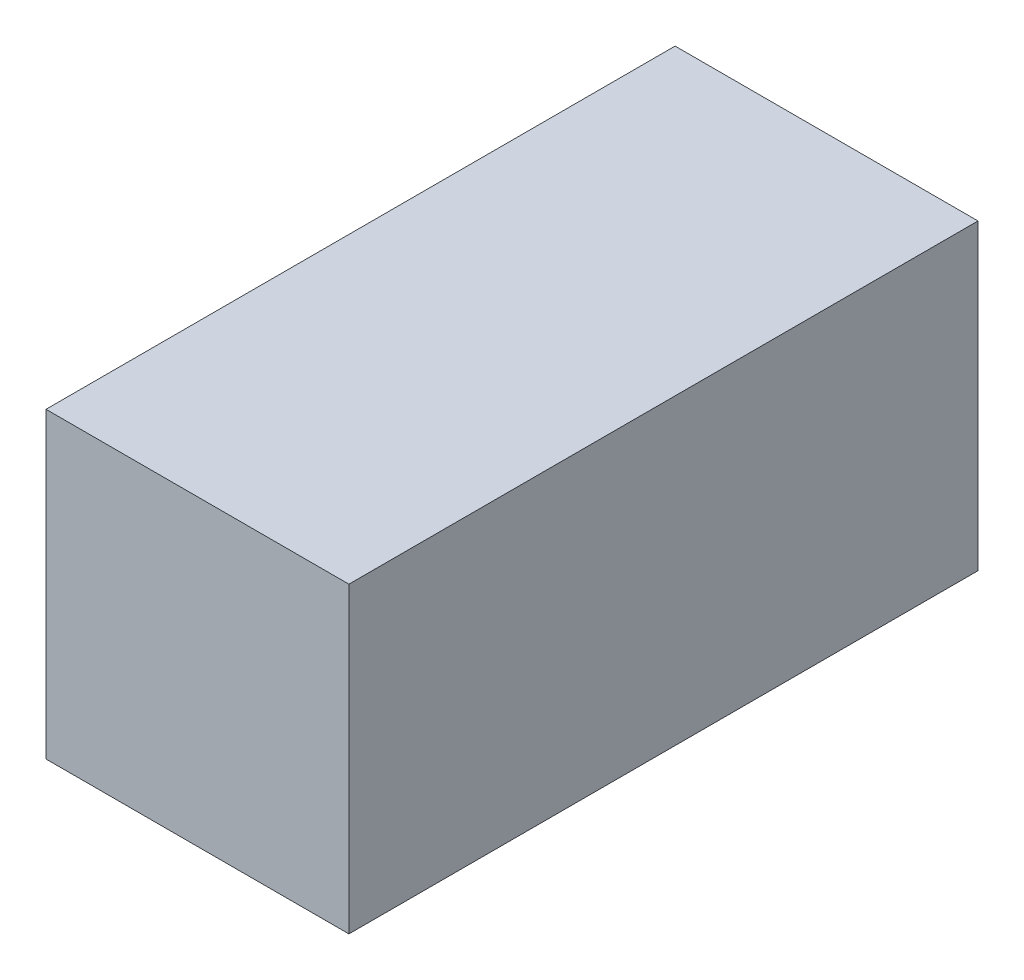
ISO-10303-21;
HEADER;
FILE_DESCRIPTION(('STEP AP214'),'2;1');
FILE_NAME('part.step','',(''),(''),'','','');
FILE_SCHEMA(('AUTOMOTIVE_DESIGN { 1 0 10303 214 1 1 1 1 }'));
ENDSEC;
DATA;
#1=APPLICATION_CONTEXT('core data for automotive mechanical design processes');
#2=APPLICATION_PROTOCOL_DEFINITION('international standard','automotive_design',2000,#1);
#3=PRODUCT_CONTEXT('',#1,'mechanical');
#4=PRODUCT('Part','Part','',(#3));
#5=PRODUCT_RELATED_PRODUCT_CATEGORY('part','',(#4));
#6=PRODUCT_DEFINITION_FORMATION('','',#4);
#7=PRODUCT_DEFINITION_CONTEXT('part definition',#1,'design');
#8=PRODUCT_DEFINITION('design','',#6,#7);
#9=PRODUCT_DEFINITION_SHAPE('','',#8);
#10=(LENGTH_UNIT() NAMED_UNIT(*) SI_UNIT(.MILLI.,.METRE.));
#11=(NAMED_UNIT(*) PLANE_ANGLE_UNIT() SI_UNIT($,.RADIAN.));
#12=(NAMED_UNIT(*) SI_UNIT($,.STERADIAN.) SOLID_ANGLE_UNIT());
#13=UNCERTAINTY_MEASURE_WITH_UNIT(LENGTH_MEASURE(1.E-05),#10,'distance_accuracy_value','');
#14=(GEOMETRIC_REPRESENTATION_CONTEXT(3) GLOBAL_UNCERTAINTY_ASSIGNED_CONTEXT((#13)) GLOBAL_UNIT_ASSIGNED_CONTEXT((#10,
#11,#12)) REPRESENTATION_CONTEXT('',''));
#15=CARTESIAN_POINT('',(0.,0.,0.));
#16=DIRECTION('',(0.,0.,1.));
#17=DIRECTION('',(1.,0.,0.));
#18=AXIS2_PLACEMENT_3D('',#15,#16,#17);
#19=CARTESIAN_POINT('',(-6.5,6.5,13.5));
#20=DIRECTION('',(1.,0.,0.));
#21=DIRECTION('',(0.,0.,-1.));
#22=AXIS2_PLACEMENT_3D('',#19,#20,#21);
#23=PLANE('',#22);
#24=DIRECTION('',(0.,-1.,0.));
#25=VECTOR('',#24,1.);
#26=CARTESIAN_POINT('',(-6.5,6.5,-13.5));
#27=LINE('',#26,#25);
#28=CARTESIAN_POINT('',(-6.5,6.5,-13.5));
#29=VERTEX_POINT('',#28);
#30=CARTESIAN_POINT('',(-6.5,-6.5,-13.5));
#31=VERTEX_POINT('',#30);
#32=EDGE_CURVE('E74',#29,#31,#27,.T.);
#33=ORIENTED_EDGE('',*,*,#32,.T.);
#34=DIRECTION('',(0.,0.,-1.));
#35=VECTOR('',#34,1.);
#36=CARTESIAN_POINT('',(-6.5,-6.5,13.5));
#37=LINE('',#36,#35);
#38=CARTESIAN_POINT('',(-6.5,-6.5,13.5));
#39=VERTEX_POINT('',#38);
#40=EDGE_CURVE('E11',#39,#31,#37,.T.);
#41=ORIENTED_EDGE('',*,*,#40,.F.);
#42=DIRECTION('',(0.,-1.,0.));
#43=VECTOR('',#42,1.);
#44=CARTESIAN_POINT('',(-6.5,6.5,13.5));
#45=LINE('',#44,#43);
#46=CARTESIAN_POINT('',(-6.5,6.5,13.5));
#47=VERTEX_POINT('',#46);
#48=EDGE_CURVE('E92',#47,#39,#45,.T.);
#49=ORIENTED_EDGE('',*,*,#48,.F.);
#50=DIRECTION('',(0.,0.,-1.));
#51=VECTOR('',#50,1.);
#52=CARTESIAN_POINT('',(-6.5,6.5,13.5));
#53=LINE('',#52,#51);
#54=EDGE_CURVE('E86',#47,#29,#53,.T.);
#55=ORIENTED_EDGE('',*,*,#54,.T.);
#56=EDGE_LOOP('',(#33,#41,#49,#55));
#57=FACE_BOUND('',#56,.T.);
#58=ADVANCED_FACE('F30',(#57),#23,.F.);
#59=CARTESIAN_POINT('',(-6.5,-6.5,13.5));
#60=DIRECTION('',(0.,1.,0.));
#61=DIRECTION('',(0.,0.,1.));
#62=AXIS2_PLACEMENT_3D('',#59,#60,#61);
#63=PLANE('',#62);
#64=DIRECTION('',(1.,0.,0.));
#65=VECTOR('',#64,1.);
#66=CARTESIAN_POINT('',(-6.5,-6.5,-13.5));
#67=LINE('',#66,#65);
#68=CARTESIAN_POINT('',(6.5,-6.5,-13.5));
#69=VERTEX_POINT('',#68);
#70=EDGE_CURVE('E70',#31,#69,#67,.T.);
#71=ORIENTED_EDGE('',*,*,#70,.T.);
#72=DIRECTION('',(0.,0.,-1.));
#73=VECTOR('',#72,1.);
#74=CARTESIAN_POINT('',(6.5,-6.5,13.5));
#75=LINE('',#74,#73);
#76=CARTESIAN_POINT('',(6.5,-6.5,13.5));
#77=VERTEX_POINT('',#76);
#78=EDGE_CURVE('E37',#77,#69,#75,.T.);
#79=ORIENTED_EDGE('',*,*,#78,.F.);
#80=DIRECTION('',(1.,0.,0.));
#81=VECTOR('',#80,1.);
#82=CARTESIAN_POINT('',(-6.5,-6.5,13.5));
#83=LINE('',#82,#81);
#84=EDGE_CURVE('E82',#39,#77,#83,.T.);
#85=ORIENTED_EDGE('',*,*,#84,.F.);
#86=ORIENTED_EDGE('',*,*,#40,.T.);
#87=EDGE_LOOP('',(#71,#79,#85,#86));
#88=FACE_BOUND('',#87,.T.);
#89=ADVANCED_FACE('F81',(#88),#63,.F.);
#90=CARTESIAN_POINT('',(6.5,6.5,13.5));
#91=DIRECTION('',(-1.,0.,0.));
#92=DIRECTION('',(0.,0.,1.));
#93=AXIS2_PLACEMENT_3D('',#90,#91,#92);
#94=PLANE('',#93);
#95=DIRECTION('',(0.,1.,0.));
#96=VECTOR('',#95,1.);
#97=CARTESIAN_POINT('',(6.5,6.5,-13.5));
#98=LINE('',#97,#96);
#99=CARTESIAN_POINT('',(6.5,6.5,-13.5));
#100=VERTEX_POINT('',#99);
#101=EDGE_CURVE('E75',#69,#100,#98,.T.);
#102=ORIENTED_EDGE('',*,*,#101,.T.);
#103=DIRECTION('',(0.,0.,-1.));
#104=VECTOR('',#103,1.);
#105=CARTESIAN_POINT('',(6.5,6.5,13.5));
#106=LINE('',#105,#104);
#107=CARTESIAN_POINT('',(6.5,6.5,13.5));
#108=VERTEX_POINT('',#107);
#109=EDGE_CURVE('E98',#108,#100,#106,.T.);
#110=ORIENTED_EDGE('',*,*,#109,.F.);
#111=DIRECTION('',(0.,1.,0.));
#112=VECTOR('',#111,1.);
#113=CARTESIAN_POINT('',(6.5,6.5,13.5));
#114=LINE('',#113,#112);
#115=EDGE_CURVE('E49',#77,#108,#114,.T.);
#116=ORIENTED_EDGE('',*,*,#115,.F.);
#117=ORIENTED_EDGE('',*,*,#78,.T.);
#118=EDGE_LOOP('',(#102,#110,#116,#117));
#119=FACE_BOUND('',#118,.T.);
#120=ADVANCED_FACE('F101',(#119),#94,.F.);
#121=CARTESIAN_POINT('',(-6.5,6.5,13.5));
#122=DIRECTION('',(0.,-1.,0.));
#123=DIRECTION('',(0.,0.,-1.));
#124=AXIS2_PLACEMENT_3D('',#121,#122,#123);
#125=PLANE('',#124);
#126=DIRECTION('',(-1.,0.,0.));
#127=VECTOR('',#126,1.);
#128=CARTESIAN_POINT('',(-6.5,6.5,-13.5));
#129=LINE('',#128,#127);
#130=EDGE_CURVE('E90',#100,#29,#129,.T.);
#131=ORIENTED_EDGE('',*,*,#130,.T.);
#132=ORIENTED_EDGE('',*,*,#54,.F.);
#133=DIRECTION('',(-1.,0.,0.));
#134=VECTOR('',#133,1.);
#135=CARTESIAN_POINT('',(-6.5,6.5,13.5));
#136=LINE('',#135,#134);
#137=EDGE_CURVE('E44',#108,#47,#136,.T.);
#138=ORIENTED_EDGE('',*,*,#137,.F.);
#139=ORIENTED_EDGE('',*,*,#109,.T.);
#140=EDGE_LOOP('',(#131,#132,#138,#139));
#141=FACE_BOUND('',#140,.T.);
#142=ADVANCED_FACE('F103',(#141),#125,.F.);
#143=CARTESIAN_POINT('',(-6.5,-6.5,13.5));
#144=DIRECTION('',(0.,0.,1.));
#145=DIRECTION('',(1.,0.,0.));
#146=AXIS2_PLACEMENT_3D('',#143,#144,#145);
#147=PLANE('',#146);
#148=ORIENTED_EDGE('',*,*,#48,.T.);
#149=ORIENTED_EDGE('',*,*,#84,.T.);
#150=ORIENTED_EDGE('',*,*,#115,.T.);
#151=ORIENTED_EDGE('',*,*,#137,.T.);
#152=EDGE_LOOP('',(#148,#149,#150,#151));
#153=FACE_BOUND('',#152,.T.);
#154=ADVANCED_FACE('F104',(#153),#147,.T.);
#155=CARTESIAN_POINT('',(-6.5,-6.5,-13.5));
#156=DIRECTION('',(0.,0.,1.));
#157=DIRECTION('',(1.,0.,0.));
#158=AXIS2_PLACEMENT_3D('',#155,#156,#157);
#159=PLANE('',#158);
#160=ORIENTED_EDGE('',*,*,#32,.F.);
#161=ORIENTED_EDGE('',*,*,#130,.F.);
#162=ORIENTED_EDGE('',*,*,#101,.F.);
#163=ORIENTED_EDGE('',*,*,#70,.F.);
#164=EDGE_LOOP('',(#160,#161,#162,#163));
#165=FACE_BOUND('',#164,.T.);
#166=ADVANCED_FACE('F71',(#165),#159,.F.);
#167=CLOSED_SHELL('',(#58,#89,#120,#142,#154,#166));
#168=MANIFOLD_SOLID_BREP('B2',#167);
#169=ADVANCED_BREP_SHAPE_REPRESENTATION('',(#18,#168),#14);
#170=SHAPE_DEFINITION_REPRESENTATION(#9,#169);
ENDSEC;
END-ISO-10303-21;
